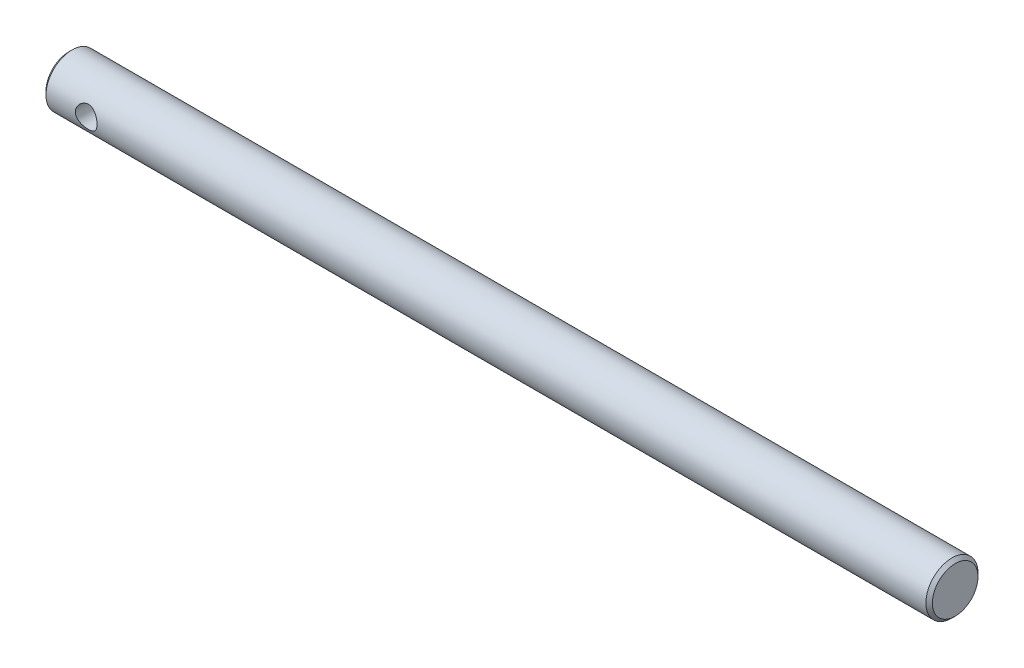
ISO-10303-21;
HEADER;
FILE_DESCRIPTION(('STEP AP214'),'2;1');
FILE_NAME('part.step','',(''),(''),'','','');
FILE_SCHEMA(('AUTOMOTIVE_DESIGN { 1 0 10303 214 1 1 1 1 }'));
ENDSEC;
DATA;
#1=APPLICATION_CONTEXT('core data for automotive mechanical design processes');
#2=APPLICATION_PROTOCOL_DEFINITION('international standard','automotive_design',2000,#1);
#3=PRODUCT_CONTEXT('',#1,'mechanical');
#4=PRODUCT('Part','Part','',(#3));
#5=PRODUCT_RELATED_PRODUCT_CATEGORY('part','',(#4));
#6=PRODUCT_DEFINITION_FORMATION('','',#4);
#7=PRODUCT_DEFINITION_CONTEXT('part definition',#1,'design');
#8=PRODUCT_DEFINITION('design','',#6,#7);
#9=PRODUCT_DEFINITION_SHAPE('','',#8);
#10=(LENGTH_UNIT() NAMED_UNIT(*) SI_UNIT(.MILLI.,.METRE.));
#11=(NAMED_UNIT(*) PLANE_ANGLE_UNIT() SI_UNIT($,.RADIAN.));
#12=(NAMED_UNIT(*) SI_UNIT($,.STERADIAN.) SOLID_ANGLE_UNIT());
#13=UNCERTAINTY_MEASURE_WITH_UNIT(LENGTH_MEASURE(1.E-05),#10,'distance_accuracy_value','');
#14=(GEOMETRIC_REPRESENTATION_CONTEXT(3) GLOBAL_UNCERTAINTY_ASSIGNED_CONTEXT((#13)) GLOBAL_UNIT_ASSIGNED_CONTEXT((#10,
#11,#12)) REPRESENTATION_CONTEXT('',''));
#15=CARTESIAN_POINT('',(0.,0.,0.));
#16=DIRECTION('',(0.,0.,1.));
#17=DIRECTION('',(1.,0.,0.));
#18=AXIS2_PLACEMENT_3D('',#15,#16,#17);
#19=CARTESIAN_POINT('',(204.,3.00000000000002,0.));
#20=DIRECTION('',(1.,0.,0.));
#21=DIRECTION('',(0.,0.,-1.));
#22=AXIS2_PLACEMENT_3D('',#19,#20,#21);
#23=PLANE('',#22);
#24=CARTESIAN_POINT('',(204.000000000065,0.,0.));
#25=DIRECTION('',(-1.,0.,0.));
#26=DIRECTION('',(0.,0.,1.));
#27=AXIS2_PLACEMENT_3D('',#24,#25,#26);
#28=CIRCLE('',#27,5.2499999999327);
#29=CARTESIAN_POINT('',(204.000000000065,0.,5.2499999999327));
#30=VERTEX_POINT('',#29);
#31=EDGE_CURVE('E20',#30,#30,#28,.T.);
#32=ORIENTED_EDGE('',*,*,#31,.F.);
#33=EDGE_LOOP('',(#32));
#34=FACE_BOUND('',#33,.T.);
#35=ADVANCED_FACE('F15',(#34),#23,.T.);
#36=CARTESIAN_POINT('',(0.,3.,0.));
#37=DIRECTION('',(-1.,0.,0.));
#38=DIRECTION('',(0.,0.,1.));
#39=AXIS2_PLACEMENT_3D('',#36,#37,#38);
#40=PLANE('',#39);
#41=CARTESIAN_POINT('',(5.6843418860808E-11,0.,0.));
#42=DIRECTION('',(1.,0.,0.));
#43=DIRECTION('',(0.,0.,-1.));
#44=AXIS2_PLACEMENT_3D('',#41,#42,#43);
#45=CIRCLE('',#44,5.25000000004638);
#46=CARTESIAN_POINT('',(5.6843418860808E-11,0.,-5.25000000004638));
#47=VERTEX_POINT('',#46);
#48=EDGE_CURVE('E74',#47,#47,#45,.T.);
#49=ORIENTED_EDGE('',*,*,#48,.F.);
#50=EDGE_LOOP('',(#49));
#51=FACE_BOUND('',#50,.T.);
#52=ADVANCED_FACE('F51',(#51),#40,.T.);
#53=CARTESIAN_POINT('',(203.250000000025,0.,0.));
#54=DIRECTION('',(-1.,0.,0.));
#55=DIRECTION('',(0.,0.,1.));
#56=AXIS2_PLACEMENT_3D('',#53,#54,#55);
#57=CONICAL_SURFACE('',#56,5.99999999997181,0.785398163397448);
#58=CARTESIAN_POINT('',(203.25,0.,0.));
#59=DIRECTION('',(1.,0.,0.));
#60=DIRECTION('',(0.,0.,-1.));
#61=AXIS2_PLACEMENT_3D('',#58,#59,#60);
#62=CIRCLE('',#61,6.00000000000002);
#63=CARTESIAN_POINT('',(203.25,0.,-6.00000000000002));
#64=VERTEX_POINT('',#63);
#65=EDGE_CURVE('E29',#64,#64,#62,.F.);
#66=ORIENTED_EDGE('',*,*,#65,.F.);
#67=EDGE_LOOP('',(#66));
#68=FACE_BOUND('',#67,.T.);
#69=ORIENTED_EDGE('',*,*,#31,.T.);
#70=EDGE_LOOP('',(#69));
#71=FACE_BOUND('',#70,.T.);
#72=ADVANCED_FACE('F47',(#68,#71),#57,.T.);
#73=CARTESIAN_POINT('',(0.749999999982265,0.,0.));
#74=DIRECTION('',(1.,0.,0.));
#75=DIRECTION('',(0.,0.,-1.));
#76=AXIS2_PLACEMENT_3D('',#73,#74,#75);
#77=CONICAL_SURFACE('',#76,5.99999999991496,0.785398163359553);
#78=CARTESIAN_POINT('',(0.749999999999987,0.,0.));
#79=DIRECTION('',(1.,0.,0.));
#80=DIRECTION('',(0.,0.,-1.));
#81=AXIS2_PLACEMENT_3D('',#78,#79,#80);
#82=CIRCLE('',#81,6.00000000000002);
#83=CARTESIAN_POINT('',(0.749999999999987,0.,-6.00000000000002));
#84=VERTEX_POINT('',#83);
#85=EDGE_CURVE('E24',#84,#84,#82,.T.);
#86=ORIENTED_EDGE('',*,*,#85,.F.);
#87=EDGE_LOOP('',(#86));
#88=FACE_BOUND('',#87,.T.);
#89=ORIENTED_EDGE('',*,*,#48,.T.);
#90=EDGE_LOOP('',(#89));
#91=FACE_BOUND('',#90,.T.);
#92=ADVANCED_FACE('F42',(#88,#91),#77,.T.);
#93=CARTESIAN_POINT('',(10.,0.,198.704665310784));
#94=DIRECTION('',(0.,0.,1.));
#95=DIRECTION('',(1.,0.,0.));
#96=AXIS2_PLACEMENT_3D('',#93,#94,#95);
#97=CYLINDRICAL_SURFACE('',#96,2.5);
#98=CARTESIAN_POINT('',(12.5,0.,-6.00000000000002));
#99=CARTESIAN_POINT('',(12.4999922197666,0.134057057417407,-5.99999370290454));
#100=CARTESIAN_POINT('',(12.4891642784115,0.268225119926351,-5.99546014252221));
#101=CARTESIAN_POINT('',(12.4462803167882,0.532641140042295,-5.97778559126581));
#102=CARTESIAN_POINT('',(12.4141952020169,0.662883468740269,-5.96463280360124));
#103=CARTESIAN_POINT('',(12.3301849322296,0.915361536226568,-5.93112874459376));
#104=CARTESIAN_POINT('',(12.2783177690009,1.03761946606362,-5.91079852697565));
#105=CARTESIAN_POINT('',(12.1564763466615,1.27162308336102,-5.86491371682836));
#106=CARTESIAN_POINT('',(12.086501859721,1.38336863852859,-5.83935905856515));
#107=CARTESIAN_POINT('',(11.9267391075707,1.59890112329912,-5.78415556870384));
#108=CARTESIAN_POINT('',(11.8361908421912,1.70209008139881,-5.75437291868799));
#109=CARTESIAN_POINT('',(11.6394636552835,1.89232584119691,-5.6946521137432));
#110=CARTESIAN_POINT('',(11.5332776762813,1.9793653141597,-5.66471389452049));
#111=CARTESIAN_POINT('',(11.3019471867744,2.13907426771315,-5.60642062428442));
#112=CARTESIAN_POINT('',(11.1761266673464,2.21082527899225,-5.57821608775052));
#113=CARTESIAN_POINT('',(10.9128551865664,2.33187819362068,-5.52871171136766));
#114=CARTESIAN_POINT('',(10.7754101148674,2.38119138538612,-5.50740840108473));
#115=CARTESIAN_POINT('',(10.4996926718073,2.4534919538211,-5.47557111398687));
#116=CARTESIAN_POINT('',(10.3617791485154,2.4776331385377,-5.46456776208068));
#117=CARTESIAN_POINT('',(10.0834535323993,2.50250419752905,-5.45322652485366));
#118=CARTESIAN_POINT('',(9.94304285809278,2.50324696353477,-5.45288276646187));
#119=CARTESIAN_POINT('',(9.67519993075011,2.48216901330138,-5.46250238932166));
#120=CARTESIAN_POINT('',(9.54759790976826,2.46207364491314,-5.47167764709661));
#121=CARTESIAN_POINT('',(9.29777591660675,2.40278384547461,-5.49796964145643));
#122=CARTESIAN_POINT('',(9.17555698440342,2.36358574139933,-5.51508790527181));
#123=CARTESIAN_POINT('',(8.93688235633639,2.26643828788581,-5.55572407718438));
#124=CARTESIAN_POINT('',(8.82060484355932,2.20810735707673,-5.57937051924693));
#125=CARTESIAN_POINT('',(8.59904060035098,2.07462195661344,-5.63036764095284));
#126=CARTESIAN_POINT('',(8.49375781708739,1.99946147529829,-5.65771964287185));
#127=CARTESIAN_POINT('',(8.28781455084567,1.82700440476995,-5.71585546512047));
#128=CARTESIAN_POINT('',(8.18829383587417,1.72837505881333,-5.74673410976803));
#129=CARTESIAN_POINT('',(8.00679501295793,1.51548855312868,-5.80650564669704));
#130=CARTESIAN_POINT('',(7.92482575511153,1.40122355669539,-5.8353975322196));
#131=CARTESIAN_POINT('',(7.77907524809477,1.15681170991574,-5.88878532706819));
#132=CARTESIAN_POINT('',(7.71577080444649,1.02635277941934,-5.91316089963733));
#133=CARTESIAN_POINT('',(7.61249735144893,0.755478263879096,-5.95381337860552));
#134=CARTESIAN_POINT('',(7.57248182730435,0.615083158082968,-5.97010641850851));
#135=CARTESIAN_POINT('',(7.53004257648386,0.394437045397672,-5.98753109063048));
#136=CARTESIAN_POINT('',(7.51879604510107,0.316059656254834,-5.99218884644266));
#137=CARTESIAN_POINT('',(7.50377251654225,0.158467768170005,-5.99842513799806));
#138=CARTESIAN_POINT('',(7.49999540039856,0.0792532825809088,-6.00000372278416));
#139=CARTESIAN_POINT('',(7.50000778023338,-0.134057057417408,-5.99999370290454));
#140=CARTESIAN_POINT('',(7.51083572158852,-0.268225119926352,-5.99546014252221));
#141=CARTESIAN_POINT('',(7.55371968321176,-0.532641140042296,-5.97778559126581));
#142=CARTESIAN_POINT('',(7.58580479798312,-0.66288346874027,-5.96463280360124));
#143=CARTESIAN_POINT('',(7.66981506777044,-0.915361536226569,-5.93112874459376));
#144=CARTESIAN_POINT('',(7.7216822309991,-1.03761946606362,-5.91079852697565));
#145=CARTESIAN_POINT('',(7.84352365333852,-1.27162308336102,-5.86491371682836));
#146=CARTESIAN_POINT('',(7.91349814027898,-1.3833686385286,-5.83935905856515));
#147=CARTESIAN_POINT('',(8.07326089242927,-1.59890112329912,-5.78415556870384));
#148=CARTESIAN_POINT('',(8.1638091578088,-1.70209008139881,-5.75437291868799));
#149=CARTESIAN_POINT('',(8.36053634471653,-1.89232584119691,-5.6946521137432));
#150=CARTESIAN_POINT('',(8.46672232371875,-1.9793653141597,-5.66471389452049));
#151=CARTESIAN_POINT('',(8.6980528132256,-2.13907426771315,-5.60642062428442));
#152=CARTESIAN_POINT('',(8.82387333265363,-2.21082527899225,-5.57821608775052));
#153=CARTESIAN_POINT('',(9.08714481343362,-2.33187819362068,-5.52871171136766));
#154=CARTESIAN_POINT('',(9.22458988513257,-2.38119138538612,-5.50740840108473));
#155=CARTESIAN_POINT('',(9.50030732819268,-2.4534919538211,-5.47557111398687));
#156=CARTESIAN_POINT('',(9.63822085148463,-2.4776331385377,-5.46456776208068));
#157=CARTESIAN_POINT('',(9.91654646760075,-2.50250419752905,-5.45322652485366));
#158=CARTESIAN_POINT('',(10.0569571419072,-2.50324696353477,-5.45288276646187));
#159=CARTESIAN_POINT('',(10.3248000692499,-2.48216901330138,-5.46250238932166));
#160=CARTESIAN_POINT('',(10.4524020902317,-2.46207364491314,-5.47167764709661));
#161=CARTESIAN_POINT('',(10.7022240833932,-2.40278384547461,-5.49796964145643));
#162=CARTESIAN_POINT('',(10.8244430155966,-2.36358574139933,-5.51508790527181));
#163=CARTESIAN_POINT('',(11.0631176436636,-2.26643828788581,-5.55572407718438));
#164=CARTESIAN_POINT('',(11.1793951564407,-2.20810735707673,-5.57937051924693));
#165=CARTESIAN_POINT('',(11.400959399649,-2.07462195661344,-5.63036764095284));
#166=CARTESIAN_POINT('',(11.5062421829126,-1.99946147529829,-5.65771964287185));
#167=CARTESIAN_POINT('',(11.7121854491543,-1.82700440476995,-5.71585546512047));
#168=CARTESIAN_POINT('',(11.8117061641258,-1.72837505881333,-5.74673410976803));
#169=CARTESIAN_POINT('',(11.9932049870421,-1.51548855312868,-5.80650564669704));
#170=CARTESIAN_POINT('',(12.0751742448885,-1.40122355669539,-5.8353975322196));
#171=CARTESIAN_POINT('',(12.2209247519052,-1.15681170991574,-5.88878532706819));
#172=CARTESIAN_POINT('',(12.2842291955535,-1.02635277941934,-5.91316089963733));
#173=CARTESIAN_POINT('',(12.3875026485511,-0.755478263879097,-5.95381337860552));
#174=CARTESIAN_POINT('',(12.4275181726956,-0.615083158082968,-5.97010641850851));
#175=CARTESIAN_POINT('',(12.4699574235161,-0.394437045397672,-5.98753109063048));
#176=CARTESIAN_POINT('',(12.4812039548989,-0.316059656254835,-5.99218884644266));
#177=CARTESIAN_POINT('',(12.4962274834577,-0.158467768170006,-5.99842513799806));
#178=CARTESIAN_POINT('',(12.5000045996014,-0.0792532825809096,-6.00000372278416));
#179=CARTESIAN_POINT('',(12.5,0.,-6.00000000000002));
#180=B_SPLINE_CURVE_WITH_KNOTS('',3,(#98,#99,#100,#101,#102,#103,#104,#105,#106,#107,#108,#109,
#110,#111,#112,#113,#114,#115,#116,#117,#118,#119,#120,#121,#122,#123,#124,#125,#126,#127,#128,
#129,#130,#131,#132,#133,#134,#135,#136,#137,#138,#139,#140,#141,#142,#143,#144,#145,#146,#147,
#148,#149,#150,#151,#152,#153,#154,#155,#156,#157,#158,#159,#160,#161,#162,#163,#164,#165,#166,
#167,#168,#169,#170,#171,#172,#173,#174,#175,#176,#177,#178,#179),.UNSPECIFIED.,.T.,.F.,(4,2,2,
2,2,2,2,2,2,2,2,2,2,2,2,2,2,2,2,2,2,2,2,2,2,2,2,2,2,2,2,2,2,2,2,2,2,2,2,2,4),(0.,
0.401862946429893,0.804277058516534,1.20552043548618,1.60676886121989,2.02637382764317,
2.44616875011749,2.8866317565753,3.32687292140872,3.74590527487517,4.16470675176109,
4.55140297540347,4.93817358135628,5.3331815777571,5.72833090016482,6.15682515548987,
6.58553496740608,7.02439953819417,7.4623845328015,7.69996594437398,7.93754357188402,
8.33940651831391,8.74182063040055,9.1430640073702,9.5443124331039,9.96391739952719,
10.3837123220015,10.8241753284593,11.2644164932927,11.6834488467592,12.1022503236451,
12.4889465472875,12.8757171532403,13.2707251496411,13.6658744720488,14.0943687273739,
14.5230785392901,14.9619431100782,15.3999281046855,15.637509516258,15.875087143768),.UNSPECIFIED.);
#181=CARTESIAN_POINT('',(12.5,0.,-6.00000000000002));
#182=VERTEX_POINT('',#181);
#183=EDGE_CURVE('E10',#182,#182,#180,.T.);
#184=ORIENTED_EDGE('',*,*,#183,.F.);
#185=EDGE_LOOP('',(#184));
#186=FACE_BOUND('',#185,.T.);
#187=CARTESIAN_POINT('',(10.,-2.5,5.45435605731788));
#188=CARTESIAN_POINT('',(9.86643633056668,-2.49999462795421,5.45436186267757));
#189=CARTESIAN_POINT('',(9.73281959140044,-2.48924637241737,5.4593243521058));
#190=CARTESIAN_POINT('',(9.46960972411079,-2.4467318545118,5.47850536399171));
#191=CARTESIAN_POINT('',(9.34002013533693,-2.41494762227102,5.49273179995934));
#192=CARTESIAN_POINT('',(9.08889794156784,-2.33180934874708,5.52853393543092));
#193=CARTESIAN_POINT('',(8.96733990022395,-2.28052094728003,5.55008495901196));
#194=CARTESIAN_POINT('',(8.73453047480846,-2.16004210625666,5.59807182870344));
#195=CARTESIAN_POINT('',(8.62328105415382,-2.09084826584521,5.62450860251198));
#196=CARTESIAN_POINT('',(8.40735062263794,-1.93194992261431,5.68111453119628));
#197=CARTESIAN_POINT('',(8.30338972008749,-1.84131153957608,5.71140993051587));
#198=CARTESIAN_POINT('',(8.1116037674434,-1.64404759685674,5.77128451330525));
#199=CARTESIAN_POINT('',(8.0237857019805,-1.53741515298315,5.8008633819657));
#200=CARTESIAN_POINT('',(7.86306837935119,-1.30548242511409,5.85752236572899));
#201=CARTESIAN_POINT('',(7.79099029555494,-1.17956936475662,5.8844364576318));
#202=CARTESIAN_POINT('',(7.66940667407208,-0.916141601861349,5.93114629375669));
#203=CARTESIAN_POINT('',(7.6198731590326,-0.778641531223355,5.95095085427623));
#204=CARTESIAN_POINT('',(7.55532712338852,-0.533915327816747,5.97710827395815));
#205=CARTESIAN_POINT('',(7.53463244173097,-0.428388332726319,5.9856395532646));
#206=CARTESIAN_POINT('',(7.50696789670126,-0.215251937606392,5.99708664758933));
#207=CARTESIAN_POINT('',(7.49999598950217,-0.107642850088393,6.00000329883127));
#208=CARTESIAN_POINT('',(7.50000499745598,0.134133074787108,5.99999588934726));
#209=CARTESIAN_POINT('',(7.51084184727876,0.268318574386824,5.99545782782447));
#210=CARTESIAN_POINT('',(7.55374054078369,0.532713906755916,5.97777678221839));
#211=CARTESIAN_POINT('',(7.5858181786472,0.662920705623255,5.96462739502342));
#212=CARTESIAN_POINT('',(7.66981213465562,0.915355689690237,5.93112998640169));
#213=CARTESIAN_POINT('',(7.72167541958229,1.03760418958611,5.91080121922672));
#214=CARTESIAN_POINT('',(7.84351460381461,1.27160790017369,5.86491699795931));
#215=CARTESIAN_POINT('',(7.91349308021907,1.38336161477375,5.83936080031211));
#216=CARTESIAN_POINT('',(8.0732617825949,1.59890253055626,5.78415526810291));
#217=CARTESIAN_POINT('',(8.16381115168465,1.70209240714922,5.75437226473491));
#218=CARTESIAN_POINT('',(8.36053868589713,1.89232770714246,5.69465145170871));
#219=CARTESIAN_POINT('',(8.46672356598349,1.97936615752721,5.66471358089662));
#220=CARTESIAN_POINT('',(8.69805270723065,2.13907420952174,5.60642065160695));
#221=CARTESIAN_POINT('',(8.82387311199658,2.21082515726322,5.57821613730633));
#222=CARTESIAN_POINT('',(9.08714457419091,2.33187810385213,5.5287117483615));
#223=CARTESIAN_POINT('',(9.22458976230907,2.3811913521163,5.50740841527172));
#224=CARTESIAN_POINT('',(9.50030728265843,2.4534919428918,5.47557111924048));
#225=CARTESIAN_POINT('',(9.63822075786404,2.4776331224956,5.46456776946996));
#226=CARTESIAN_POINT('',(9.91654637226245,2.50250419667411,5.45322652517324));
#227=CARTESIAN_POINT('',(10.0569570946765,2.50324696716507,5.45288276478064));
#228=CARTESIAN_POINT('',(10.3248000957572,2.48216901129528,5.46250239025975));
#229=CARTESIAN_POINT('',(10.4524021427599,2.4620736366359,5.47167765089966));
#230=CARTESIAN_POINT('',(10.7022241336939,2.40278382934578,5.49796964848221));
#231=CARTESIAN_POINT('',(10.8244430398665,2.36358573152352,5.51508790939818));
#232=CARTESIAN_POINT('',(11.0631176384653,2.26643828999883,5.55572407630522));
#233=CARTESIAN_POINT('',(11.1793951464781,2.208107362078,5.57937051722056));
#234=CARTESIAN_POINT('',(11.4009593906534,2.0746219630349,5.63036763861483));
#235=CARTESIAN_POINT('',(11.5062421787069,1.99946147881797,5.65771964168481));
#236=CARTESIAN_POINT('',(11.7121854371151,1.82700441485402,5.71585546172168));
#237=CARTESIAN_POINT('',(11.8117061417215,1.72837508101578,5.74673410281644));
#238=CARTESIAN_POINT('',(11.9932049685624,1.5154885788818,5.80650564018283));
#239=CARTESIAN_POINT('',(12.0751742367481,1.40122357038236,5.83539752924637));
#240=CARTESIAN_POINT('',(12.2209247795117,1.15681166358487,5.88878533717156));
#241=CARTESIAN_POINT('',(12.2842292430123,1.0263526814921,5.91316091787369));
#242=CARTESIAN_POINT('',(12.387502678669,0.755478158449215,5.95381339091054));
#243=CARTESIAN_POINT('',(12.4275181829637,0.615083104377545,5.97010642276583));
#244=CARTESIAN_POINT('',(12.4699574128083,0.394437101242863,5.98753108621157));
#245=CARTESIAN_POINT('',(12.4812039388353,0.316059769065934,5.99218883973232));
#246=CARTESIAN_POINT('',(12.4962274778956,0.158467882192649,5.99842513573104));
#247=CARTESIAN_POINT('',(12.5000045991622,0.0792533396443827,6.00000372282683));
#248=CARTESIAN_POINT('',(12.4999922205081,-0.134057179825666,5.99999370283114));
#249=CARTESIAN_POINT('',(12.4891642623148,-0.268225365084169,5.99546013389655));
#250=CARTESIAN_POINT('',(12.4462802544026,-0.532641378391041,5.97778556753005));
#251=CARTESIAN_POINT('',(12.4141951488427,-0.662883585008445,5.96463278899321));
#252=CARTESIAN_POINT('',(12.3301846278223,-0.915362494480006,5.93112861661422));
#253=CARTESIAN_POINT('',(12.2783170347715,-1.03762132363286,5.91079821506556));
#254=CARTESIAN_POINT('',(12.1564752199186,-1.27162479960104,5.86491332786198));
#255=CARTESIAN_POINT('',(12.0865010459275,-1.38336947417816,5.83935885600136));
#256=CARTESIAN_POINT('',(11.9267451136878,-1.59889329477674,5.78415756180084));
#257=CARTESIAN_POINT('',(11.836204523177,-1.70207535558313,5.75437711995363));
#258=CARTESIAN_POINT('',(11.6394778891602,-1.89231357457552,5.69465638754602));
#259=CARTESIAN_POINT('',(11.5332825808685,-1.97936011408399,5.6647160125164));
#260=CARTESIAN_POINT('',(11.3019001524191,-2.13910864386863,5.60640784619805));
#261=CARTESIAN_POINT('',(11.176032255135,-2.21088488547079,5.5781917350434));
#262=CARTESIAN_POINT('',(10.9127252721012,-2.33192175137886,5.52869386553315));
#263=CARTESIAN_POINT('',(10.7753020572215,-2.38121267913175,5.50740278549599));
#264=CARTESIAN_POINT('',(10.531169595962,-2.44524299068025,5.4792007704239));
#265=CARTESIAN_POINT('',(10.4262051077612,-2.46572150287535,5.46995803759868));
#266=CARTESIAN_POINT('',(10.2141714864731,-2.49310071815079,5.45753399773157));
#267=CARTESIAN_POINT('',(10.1071028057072,-2.50000430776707,5.45435140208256));
#268=CARTESIAN_POINT('',(10.,-2.5,5.45435605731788));
#269=B_SPLINE_CURVE_WITH_KNOTS('',3,(#187,#188,#189,#190,#191,#192,#193,#194,#195,#196,#197,
#198,#199,#200,#201,#202,#203,#204,#205,#206,#207,#208,#209,#210,#211,#212,#213,#214,#215,#216,
#217,#218,#219,#220,#221,#222,#223,#224,#225,#226,#227,#228,#229,#230,#231,#232,#233,#234,#235,
#236,#237,#238,#239,#240,#241,#242,#243,#244,#245,#246,#247,#248,#249,#250,#251,#252,#253,#254,
#255,#256,#257,#258,#259,#260,#261,#262,#263,#264,#265,#266,#267,#268),.UNSPECIFIED.,.T.,.F.,(4,
2,2,2,2,2,2,2,2,2,2,2,2,2,2,2,2,2,2,2,2,2,2,2,2,2,2,2,2,2,2,2,2,2,2,2,2,2,2,2,4),(0.,
0.400275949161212,0.800894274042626,1.20017611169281,1.59953384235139,2.02132687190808,
2.44330197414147,2.88374569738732,3.32364133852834,3.6462886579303,3.96888791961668,
4.37087681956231,4.77316496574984,5.17438231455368,5.57565677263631,5.99526634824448,
6.41505666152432,6.85551928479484,7.29576083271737,7.714793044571,8.13359466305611,
8.52029096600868,8.90706149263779,9.30206947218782,9.69721881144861,10.1257130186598,
10.5544228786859,10.9932876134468,11.431272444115,11.6688536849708,11.9064314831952,
12.3082947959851,12.7107085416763,13.1119549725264,13.5132003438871,13.9327756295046,
14.3526002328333,14.7932501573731,15.2333044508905,15.5543483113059,15.8753238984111),.UNSPECIFIED.);
#270=CARTESIAN_POINT('',(10.,-2.5,5.45435605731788));
#271=VERTEX_POINT('',#270);
#272=EDGE_CURVE('E35',#271,#271,#269,.T.);
#273=ORIENTED_EDGE('',*,*,#272,.F.);
#274=EDGE_LOOP('',(#273));
#275=FACE_BOUND('',#274,.T.);
#276=ADVANCED_FACE('F38',(#186,#275),#97,.F.);
#277=CARTESIAN_POINT('',(102.,0.,0.));
#278=DIRECTION('',(1.,0.,0.));
#279=DIRECTION('',(0.,0.,-1.));
#280=AXIS2_PLACEMENT_3D('',#277,#278,#279);
#281=CYLINDRICAL_SURFACE('',#280,6.00000000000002);
#282=ORIENTED_EDGE('',*,*,#65,.T.);
#283=EDGE_LOOP('',(#282));
#284=FACE_BOUND('',#283,.T.);
#285=ORIENTED_EDGE('',*,*,#183,.T.);
#286=EDGE_LOOP('',(#285));
#287=FACE_BOUND('',#286,.T.);
#288=ORIENTED_EDGE('',*,*,#85,.T.);
#289=EDGE_LOOP('',(#288));
#290=FACE_BOUND('',#289,.T.);
#291=ORIENTED_EDGE('',*,*,#272,.T.);
#292=EDGE_LOOP('',(#291));
#293=FACE_BOUND('',#292,.T.);
#294=ADVANCED_FACE('F17',(#284,#287,#290,#293),#281,.T.);
#295=CLOSED_SHELL('',(#35,#52,#72,#92,#276,#294));
#296=MANIFOLD_SOLID_BREP('B1',#295);
#297=ADVANCED_BREP_SHAPE_REPRESENTATION('',(#18,#296),#14);
#298=SHAPE_DEFINITION_REPRESENTATION(#9,#297);
ENDSEC;
END-ISO-10303-21;
